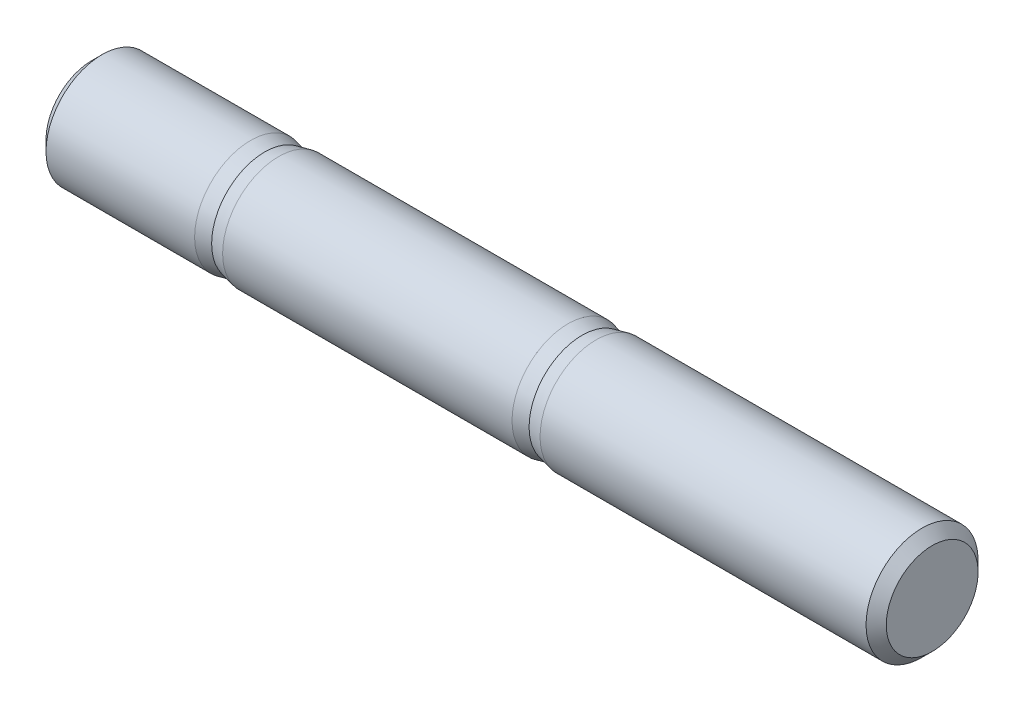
ISO-10303-21;
HEADER;
FILE_DESCRIPTION(('STEP AP214'),'2;1');
FILE_NAME('part.step','',(''),(''),'','','');
FILE_SCHEMA(('AUTOMOTIVE_DESIGN { 1 0 10303 214 1 1 1 1 }'));
ENDSEC;
DATA;
#1=APPLICATION_CONTEXT('core data for automotive mechanical design processes');
#2=APPLICATION_PROTOCOL_DEFINITION('international standard','automotive_design',2000,#1);
#3=PRODUCT_CONTEXT('',#1,'mechanical');
#4=PRODUCT('Part','Part','',(#3));
#5=PRODUCT_RELATED_PRODUCT_CATEGORY('part','',(#4));
#6=PRODUCT_DEFINITION_FORMATION('','',#4);
#7=PRODUCT_DEFINITION_CONTEXT('part definition',#1,'design');
#8=PRODUCT_DEFINITION('design','',#6,#7);
#9=PRODUCT_DEFINITION_SHAPE('','',#8);
#10=(LENGTH_UNIT() NAMED_UNIT(*) SI_UNIT(.MILLI.,.METRE.));
#11=(NAMED_UNIT(*) PLANE_ANGLE_UNIT() SI_UNIT($,.RADIAN.));
#12=(NAMED_UNIT(*) SI_UNIT($,.STERADIAN.) SOLID_ANGLE_UNIT());
#13=UNCERTAINTY_MEASURE_WITH_UNIT(LENGTH_MEASURE(1.E-05),#10,'distance_accuracy_value','');
#14=(GEOMETRIC_REPRESENTATION_CONTEXT(3) GLOBAL_UNCERTAINTY_ASSIGNED_CONTEXT((#13)) GLOBAL_UNIT_ASSIGNED_CONTEXT((#10,
#11,#12)) REPRESENTATION_CONTEXT('',''));
#15=CARTESIAN_POINT('',(0.,0.,0.));
#16=DIRECTION('',(0.,0.,1.));
#17=DIRECTION('',(1.,0.,0.));
#18=AXIS2_PLACEMENT_3D('',#15,#16,#17);
#19=CARTESIAN_POINT('',(10.,0.,0.));
#20=DIRECTION('',(-1.,0.,0.));
#21=DIRECTION('',(0.,0.,1.));
#22=AXIS2_PLACEMENT_3D('',#19,#20,#21);
#23=CONICAL_SURFACE('',#22,2.675,0.213368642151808);
#24=CARTESIAN_POINT('',(8.5,0.,0.));
#25=DIRECTION('',(-1.,0.,0.));
#26=DIRECTION('',(0.,0.,1.));
#27=AXIS2_PLACEMENT_3D('',#24,#25,#26);
#28=CIRCLE('',#27,3.);
#29=CARTESIAN_POINT('',(8.5,0.,3.));
#30=VERTEX_POINT('',#29);
#31=EDGE_CURVE('E58',#30,#30,#28,.T.);
#32=ORIENTED_EDGE('',*,*,#31,.F.);
#33=EDGE_LOOP('',(#32));
#34=FACE_BOUND('',#33,.T.);
#35=CARTESIAN_POINT('',(9.25,0.,0.));
#36=DIRECTION('',(1.,0.,0.));
#37=DIRECTION('',(0.,0.,-1.));
#38=AXIS2_PLACEMENT_3D('',#35,#36,#37);
#39=CIRCLE('',#38,2.8375);
#40=CARTESIAN_POINT('',(9.25,0.,-2.8375));
#41=VERTEX_POINT('',#40);
#42=EDGE_CURVE('E10',#41,#41,#39,.T.);
#43=ORIENTED_EDGE('',*,*,#42,.F.);
#44=EDGE_LOOP('',(#43));
#45=FACE_BOUND('',#44,.T.);
#46=ADVANCED_FACE('F32',(#34,#45),#23,.T.);
#47=CARTESIAN_POINT('',(0.,0.,0.));
#48=DIRECTION('',(1.,0.,0.));
#49=DIRECTION('',(0.,0.,-1.));
#50=AXIS2_PLACEMENT_3D('',#47,#48,#49);
#51=PLANE('',#50);
#52=CARTESIAN_POINT('',(0.,0.,0.));
#53=DIRECTION('',(1.,0.,0.));
#54=DIRECTION('',(0.,0.,-1.));
#55=AXIS2_PLACEMENT_3D('',#52,#53,#54);
#56=CIRCLE('',#55,2.4585);
#57=CARTESIAN_POINT('',(0.,0.,-2.4585));
#58=VERTEX_POINT('',#57);
#59=EDGE_CURVE('E55',#58,#58,#56,.F.);
#60=ORIENTED_EDGE('',*,*,#59,.T.);
#61=EDGE_LOOP('',(#60));
#62=FACE_BOUND('',#61,.T.);
#63=ADVANCED_FACE('F88',(#62),#51,.F.);
#64=CARTESIAN_POINT('',(-1.31084166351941,0.,0.));
#65=DIRECTION('',(-1.,0.,0.));
#66=DIRECTION('',(0.,0.,1.));
#67=AXIS2_PLACEMENT_3D('',#64,#65,#66);
#68=CYLINDRICAL_SURFACE('',#67,3.);
#69=CARTESIAN_POINT('',(0.541499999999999,0.,0.));
#70=DIRECTION('',(1.,0.,0.));
#71=DIRECTION('',(0.,0.,-1.));
#72=AXIS2_PLACEMENT_3D('',#69,#70,#71);
#73=CIRCLE('',#72,3.);
#74=CARTESIAN_POINT('',(0.541499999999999,0.,-3.));
#75=VERTEX_POINT('',#74);
#76=EDGE_CURVE('E52',#75,#75,#73,.T.);
#77=ORIENTED_EDGE('',*,*,#76,.T.);
#78=EDGE_LOOP('',(#77));
#79=FACE_BOUND('',#78,.T.);
#80=ORIENTED_EDGE('',*,*,#31,.T.);
#81=EDGE_LOOP('',(#80));
#82=FACE_BOUND('',#81,.T.);
#83=ADVANCED_FACE('F94',(#79,#82),#68,.T.);
#84=CARTESIAN_POINT('',(0.,0.,0.));
#85=DIRECTION('',(1.,0.,0.));
#86=DIRECTION('',(0.,0.,-1.));
#87=AXIS2_PLACEMENT_3D('',#84,#85,#86);
#88=CONICAL_SURFACE('',#87,2.4585,0.785398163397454);
#89=ORIENTED_EDGE('',*,*,#76,.F.);
#90=EDGE_LOOP('',(#89));
#91=FACE_BOUND('',#90,.T.);
#92=ORIENTED_EDGE('',*,*,#59,.F.);
#93=EDGE_LOOP('',(#92));
#94=FACE_BOUND('',#93,.T.);
#95=ADVANCED_FACE('F84',(#91,#94),#88,.T.);
#96=CARTESIAN_POINT('',(10.,0.,0.));
#97=DIRECTION('',(1.,0.,0.));
#98=DIRECTION('',(0.,0.,-1.));
#99=AXIS2_PLACEMENT_3D('',#96,#97,#98);
#100=CONICAL_SURFACE('',#99,3.,0.213368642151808);
#101=CARTESIAN_POINT('',(10.,0.,0.));
#102=DIRECTION('',(-1.,0.,0.));
#103=DIRECTION('',(0.,0.,1.));
#104=AXIS2_PLACEMENT_3D('',#101,#102,#103);
#105=CIRCLE('',#104,3.);
#106=CARTESIAN_POINT('',(10.,0.,3.));
#107=VERTEX_POINT('',#106);
#108=EDGE_CURVE('E64',#107,#107,#105,.T.);
#109=ORIENTED_EDGE('',*,*,#108,.T.);
#110=EDGE_LOOP('',(#109));
#111=FACE_BOUND('',#110,.T.);
#112=ORIENTED_EDGE('',*,*,#42,.T.);
#113=EDGE_LOOP('',(#112));
#114=FACE_BOUND('',#113,.T.);
#115=ADVANCED_FACE('F75',(#111,#114),#100,.T.);
#116=CARTESIAN_POINT('',(27.,0.,0.));
#117=DIRECTION('',(-1.,0.,0.));
#118=DIRECTION('',(0.,0.,1.));
#119=AXIS2_PLACEMENT_3D('',#116,#117,#118);
#120=CONICAL_SURFACE('',#119,2.675,0.213368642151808);
#121=CARTESIAN_POINT('',(25.5,0.,0.));
#122=DIRECTION('',(-1.,0.,0.));
#123=DIRECTION('',(0.,0.,1.));
#124=AXIS2_PLACEMENT_3D('',#121,#122,#123);
#125=CIRCLE('',#124,3.);
#126=CARTESIAN_POINT('',(25.5,0.,3.));
#127=VERTEX_POINT('',#126);
#128=EDGE_CURVE('E67',#127,#127,#125,.T.);
#129=ORIENTED_EDGE('',*,*,#128,.F.);
#130=EDGE_LOOP('',(#129));
#131=FACE_BOUND('',#130,.T.);
#132=CARTESIAN_POINT('',(26.25,0.,0.));
#133=DIRECTION('',(-1.,0.,0.));
#134=DIRECTION('',(0.,0.,1.));
#135=AXIS2_PLACEMENT_3D('',#132,#133,#134);
#136=CIRCLE('',#135,2.8375);
#137=CARTESIAN_POINT('',(26.25,0.,2.8375));
#138=VERTEX_POINT('',#137);
#139=EDGE_CURVE('E39',#138,#138,#136,.T.);
#140=ORIENTED_EDGE('',*,*,#139,.T.);
#141=EDGE_LOOP('',(#140));
#142=FACE_BOUND('',#141,.T.);
#143=ADVANCED_FACE('F73',(#131,#142),#120,.T.);
#144=CARTESIAN_POINT('',(-1.31084166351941,0.,0.));
#145=DIRECTION('',(-1.,0.,0.));
#146=DIRECTION('',(0.,0.,1.));
#147=AXIS2_PLACEMENT_3D('',#144,#145,#146);
#148=CYLINDRICAL_SURFACE('',#147,3.);
#149=ORIENTED_EDGE('',*,*,#108,.F.);
#150=EDGE_LOOP('',(#149));
#151=FACE_BOUND('',#150,.T.);
#152=ORIENTED_EDGE('',*,*,#128,.T.);
#153=EDGE_LOOP('',(#152));
#154=FACE_BOUND('',#153,.T.);
#155=ADVANCED_FACE('F71',(#151,#154),#148,.T.);
#156=CARTESIAN_POINT('',(45.,3.,0.));
#157=DIRECTION('',(-1.,0.,0.));
#158=DIRECTION('',(0.,0.,1.));
#159=AXIS2_PLACEMENT_3D('',#156,#157,#158);
#160=PLANE('',#159);
#161=CARTESIAN_POINT('',(45.,0.,0.));
#162=DIRECTION('',(-1.,0.,0.));
#163=DIRECTION('',(0.,0.,1.));
#164=AXIS2_PLACEMENT_3D('',#161,#162,#163);
#165=CIRCLE('',#164,2.45850000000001);
#166=CARTESIAN_POINT('',(45.,0.,2.45850000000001));
#167=VERTEX_POINT('',#166);
#168=EDGE_CURVE('E43',#167,#167,#165,.F.);
#169=ORIENTED_EDGE('',*,*,#168,.T.);
#170=EDGE_LOOP('',(#169));
#171=FACE_BOUND('',#170,.T.);
#172=ADVANCED_FACE('F81',(#171),#160,.F.);
#173=CARTESIAN_POINT('',(44.4585,0.,0.));
#174=DIRECTION('',(-1.,0.,0.));
#175=DIRECTION('',(0.,0.,1.));
#176=AXIS2_PLACEMENT_3D('',#173,#174,#175);
#177=CONICAL_SURFACE('',#176,3.,0.785398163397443);
#178=ORIENTED_EDGE('',*,*,#168,.F.);
#179=EDGE_LOOP('',(#178));
#180=FACE_BOUND('',#179,.T.);
#181=CARTESIAN_POINT('',(44.4585,0.,0.));
#182=DIRECTION('',(-1.,0.,0.));
#183=DIRECTION('',(0.,0.,1.));
#184=AXIS2_PLACEMENT_3D('',#181,#182,#183);
#185=CIRCLE('',#184,3.);
#186=CARTESIAN_POINT('',(44.4585,0.,3.));
#187=VERTEX_POINT('',#186);
#188=EDGE_CURVE('E47',#187,#187,#185,.T.);
#189=ORIENTED_EDGE('',*,*,#188,.F.);
#190=EDGE_LOOP('',(#189));
#191=FACE_BOUND('',#190,.T.);
#192=ADVANCED_FACE('F34',(#180,#191),#177,.T.);
#193=CARTESIAN_POINT('',(-1.31084166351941,0.,0.));
#194=DIRECTION('',(-1.,0.,0.));
#195=DIRECTION('',(0.,0.,1.));
#196=AXIS2_PLACEMENT_3D('',#193,#194,#195);
#197=CYLINDRICAL_SURFACE('',#196,3.);
#198=ORIENTED_EDGE('',*,*,#188,.T.);
#199=EDGE_LOOP('',(#198));
#200=FACE_BOUND('',#199,.T.);
#201=CARTESIAN_POINT('',(27.,0.,0.));
#202=DIRECTION('',(-1.,0.,0.));
#203=DIRECTION('',(0.,0.,1.));
#204=AXIS2_PLACEMENT_3D('',#201,#202,#203);
#205=CIRCLE('',#204,3.);
#206=CARTESIAN_POINT('',(27.,0.,3.));
#207=VERTEX_POINT('',#206);
#208=EDGE_CURVE('E61',#207,#207,#205,.T.);
#209=ORIENTED_EDGE('',*,*,#208,.F.);
#210=EDGE_LOOP('',(#209));
#211=FACE_BOUND('',#210,.T.);
#212=ADVANCED_FACE('F142',(#200,#211),#197,.T.);
#213=CARTESIAN_POINT('',(27.,0.,0.));
#214=DIRECTION('',(1.,0.,0.));
#215=DIRECTION('',(0.,0.,-1.));
#216=AXIS2_PLACEMENT_3D('',#213,#214,#215);
#217=CONICAL_SURFACE('',#216,3.,0.213368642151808);
#218=ORIENTED_EDGE('',*,*,#208,.T.);
#219=EDGE_LOOP('',(#218));
#220=FACE_BOUND('',#219,.T.);
#221=ORIENTED_EDGE('',*,*,#139,.F.);
#222=EDGE_LOOP('',(#221));
#223=FACE_BOUND('',#222,.T.);
#224=ADVANCED_FACE('F101',(#220,#223),#217,.T.);
#225=CLOSED_SHELL('',(#46,#63,#83,#95,#115,#143,#155,#172,#192,#212,#224));
#226=MANIFOLD_SOLID_BREP('B2',#225);
#227=ADVANCED_BREP_SHAPE_REPRESENTATION('',(#18,#226),#14);
#228=SHAPE_DEFINITION_REPRESENTATION(#9,#227);
ENDSEC;
END-ISO-10303-21;
